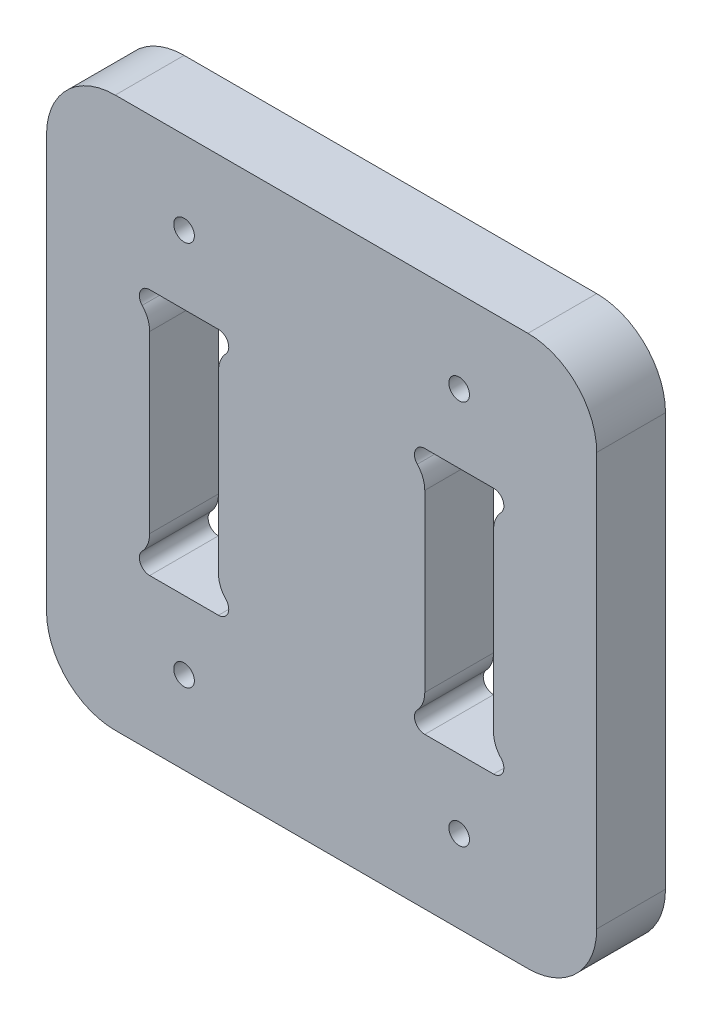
from build123d import *

# Parameters (mm, degrees)
ESQUISSE1_R        = 1.5
BOSS_EXTRU_1_DEPTH = 10


with BuildPart() as part:
    # Esquisse1 → Boss.-Extru.1 (new body)
    with BuildSketch(Plane.XY):
        with BuildLine():
            Line((-30, 40), (30, 40))
            ThreePointArc((30, 40), (37.071067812, 37.071067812), (40, 30))
            Line((40, 30), (40, -30))
            ThreePointArc((40, -30), (37.071067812, -37.071067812), (30, -40))
            Line((30, -40), (-30, -40))
            ThreePointArc((-30, -40), (-37.071067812, -37.071067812), (-40, -30))
            Line((-40, -30), (-40, 30))
            ThreePointArc((-40, 30), (-37.071067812, 37.071067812), (-30, 40))
        make_face()
        with Locations((-20, 28)):
            Circle(ESQUISSE1_R, mode=Mode.SUBTRACT)
        with Locations((-20, -28)):
            Circle(ESQUISSE1_R, mode=Mode.SUBTRACT)
        with Locations(Location((20, -28, 0), (0, 0, 180))):
            Circle(ESQUISSE1_R, mode=Mode.SUBTRACT)
        with Locations(Location((20, 28, 0), (0, 0, 180))):
            Circle(ESQUISSE1_R, mode=Mode.SUBTRACT)
        with BuildLine():
            Line((-15, -18), (-25, -18))
            ThreePointArc((-25, -18), (-26.377367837, -17.094018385), (-26.090909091, -15.470477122))
            ThreePointArc((-26.090909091, -15.470477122), (-25.282718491, -14.202180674), (-25, -12.725082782))
            Line((-25, -12.725082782), (-25, 12.725082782))
            ThreePointArc((-25, 12.725082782), (-25.282718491, 14.202180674), (-26.090909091, 15.470477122))
            ThreePointArc((-26.090909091, 15.470477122), (-26.377367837, 17.094018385), (-25, 18))
            Line((-25, 18), (-15, 18))
            ThreePointArc((-15, 18), (-13.622632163, 17.094018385), (-13.909090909, 15.470477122))
            ThreePointArc((-13.909090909, 15.470477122), (-14.717281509, 14.202180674), (-15, 12.725082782))
            Line((-15, 12.725082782), (-15, -12.725082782))
            ThreePointArc((-15, -12.725082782), (-14.717281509, -14.202180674), (-13.909090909, -15.470477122))
            ThreePointArc((-13.909090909, -15.470477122), (-13.622632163, -17.094018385), (-15, -18))
        make_face(mode=Mode.SUBTRACT)
        with BuildLine():
            Line((15, 12.725082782), (15, -12.725082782))
            ThreePointArc((15, -12.725082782), (14.717281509, -14.202180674), (13.909090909, -15.470477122))
            ThreePointArc((13.909090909, -15.470477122), (13.622632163, -17.094018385), (15, -18))
            Line((15, -18), (25, -18))
            ThreePointArc((25, -18), (26.377367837, -17.094018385), (26.090909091, -15.470477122))
            ThreePointArc((26.090909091, -15.470477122), (25.282718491, -14.202180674), (25, -12.725082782))
            Line((25, -12.725082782), (25, 12.725082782))
            ThreePointArc((25, 12.725082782), (25.282718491, 14.202180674), (26.090909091, 15.470477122))
            ThreePointArc((26.090909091, 15.470477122), (26.377367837, 17.094018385), (25, 18))
            Line((25, 18), (15, 18))
            ThreePointArc((15, 18), (13.622632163, 17.094018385), (13.909090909, 15.470477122))
            ThreePointArc((13.909090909, 15.470477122), (14.717281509, 14.202180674), (15, 12.725082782))
        make_face(mode=Mode.SUBTRACT)
    extrude(amount=BOSS_EXTRU_1_DEPTH)


solid = part.part
